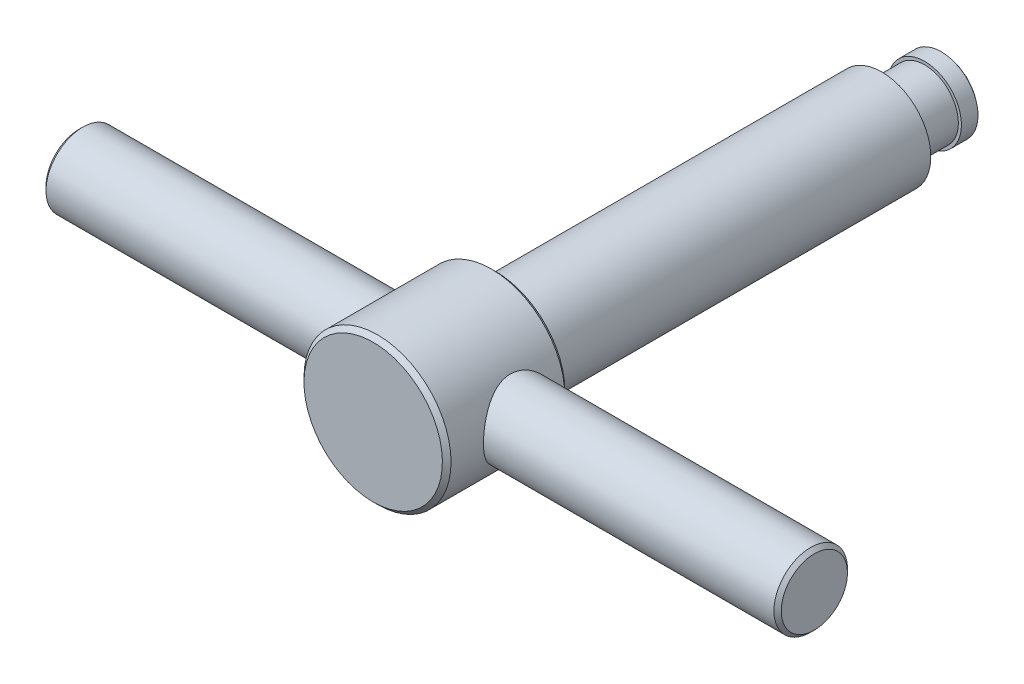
ISO-10303-21;
HEADER;
FILE_DESCRIPTION(('STEP AP214'),'2;1');
FILE_NAME('part.step','',(''),(''),'','','');
FILE_SCHEMA(('AUTOMOTIVE_DESIGN { 1 0 10303 214 1 1 1 1 }'));
ENDSEC;
DATA;
#1=APPLICATION_CONTEXT('core data for automotive mechanical design processes');
#2=APPLICATION_PROTOCOL_DEFINITION('international standard','automotive_design',2000,#1);
#3=PRODUCT_CONTEXT('',#1,'mechanical');
#4=PRODUCT('Part','Part','',(#3));
#5=PRODUCT_RELATED_PRODUCT_CATEGORY('part','',(#4));
#6=PRODUCT_DEFINITION_FORMATION('','',#4);
#7=PRODUCT_DEFINITION_CONTEXT('part definition',#1,'design');
#8=PRODUCT_DEFINITION('design','',#6,#7);
#9=PRODUCT_DEFINITION_SHAPE('','',#8);
#10=(LENGTH_UNIT() NAMED_UNIT(*) SI_UNIT(.MILLI.,.METRE.));
#11=(NAMED_UNIT(*) PLANE_ANGLE_UNIT() SI_UNIT($,.RADIAN.));
#12=(NAMED_UNIT(*) SI_UNIT($,.STERADIAN.) SOLID_ANGLE_UNIT());
#13=UNCERTAINTY_MEASURE_WITH_UNIT(LENGTH_MEASURE(1.E-05),#10,'distance_accuracy_value','');
#14=(GEOMETRIC_REPRESENTATION_CONTEXT(3) GLOBAL_UNCERTAINTY_ASSIGNED_CONTEXT((#13)) GLOBAL_UNIT_ASSIGNED_CONTEXT((#10,
#11,#12)) REPRESENTATION_CONTEXT('',''));
#15=CARTESIAN_POINT('',(0.,0.,0.));
#16=DIRECTION('',(0.,0.,1.));
#17=DIRECTION('',(1.,0.,0.));
#18=AXIS2_PLACEMENT_3D('',#15,#16,#17);
#19=CARTESIAN_POINT('',(-60.,0.,88.4));
#20=DIRECTION('',(1.,0.,0.));
#21=DIRECTION('',(0.,1.,0.));
#22=AXIS2_PLACEMENT_3D('',#19,#20,#21);
#23=PLANE('',#22);
#24=CARTESIAN_POINT('',(-60.0000000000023,0.,83.));
#25=DIRECTION('',(1.,0.,0.));
#26=DIRECTION('',(0.,1.,0.));
#27=AXIS2_PLACEMENT_3D('',#24,#25,#26);
#28=CIRCLE('',#27,5.39999999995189);
#29=CARTESIAN_POINT('',(-60.0000000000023,5.39999999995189,83.));
#30=VERTEX_POINT('',#29);
#31=EDGE_CURVE('E15',#30,#30,#28,.T.);
#32=ORIENTED_EDGE('',*,*,#31,.F.);
#33=EDGE_LOOP('',(#32));
#34=FACE_BOUND('',#33,.T.);
#35=ADVANCED_FACE('F12',(#34),#23,.F.);
#36=CARTESIAN_POINT('',(60.,0.,83.));
#37=DIRECTION('',(-1.,0.,0.));
#38=DIRECTION('',(0.,-1.,0.));
#39=AXIS2_PLACEMENT_3D('',#36,#37,#38);
#40=PLANE('',#39);
#41=CARTESIAN_POINT('',(60.0000000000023,0.,83.));
#42=DIRECTION('',(-1.,0.,0.));
#43=DIRECTION('',(0.,0.,1.));
#44=AXIS2_PLACEMENT_3D('',#41,#42,#43);
#45=CIRCLE('',#44,5.40000000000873);
#46=CARTESIAN_POINT('',(60.0000000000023,0.,88.4000000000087));
#47=VERTEX_POINT('',#46);
#48=EDGE_CURVE('E133',#47,#47,#45,.T.);
#49=ORIENTED_EDGE('',*,*,#48,.F.);
#50=EDGE_LOOP('',(#49));
#51=FACE_BOUND('',#50,.T.);
#52=ADVANCED_FACE('F171',(#51),#40,.F.);
#53=CARTESIAN_POINT('',(0.,0.,9.));
#54=DIRECTION('',(1.,0.,0.));
#55=DIRECTION('',(0.,-1.,0.));
#56=AXIS2_PLACEMENT_3D('',#53,#54,#55);
#57=SPHERICAL_SURFACE('',#56,9.);
#58=CARTESIAN_POINT('',(0.,0.,2.29179606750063));
#59=DIRECTION('',(0.,0.,1.));
#60=DIRECTION('',(0.,1.,0.));
#61=AXIS2_PLACEMENT_3D('',#58,#59,#60);
#62=CIRCLE('',#61,6.);
#63=CARTESIAN_POINT('',(0.,6.,2.29179606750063));
#64=VERTEX_POINT('',#63);
#65=EDGE_CURVE('E126',#64,#64,#62,.T.);
#66=ORIENTED_EDGE('',*,*,#65,.F.);
#67=EDGE_LOOP('',(#66));
#68=FACE_BOUND('',#67,.T.);
#69=ADVANCED_FACE('F168',(#68),#57,.T.);
#70=CARTESIAN_POINT('',(-59.400000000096,0.,83.));
#71=DIRECTION('',(1.,0.,0.));
#72=DIRECTION('',(0.,1.,0.));
#73=AXIS2_PLACEMENT_3D('',#70,#71,#72);
#74=CONICAL_SURFACE('',#73,5.99999999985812,0.785398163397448);
#75=CARTESIAN_POINT('',(-59.4,0.,83.));
#76=DIRECTION('',(1.,0.,0.));
#77=DIRECTION('',(0.,1.,0.));
#78=AXIS2_PLACEMENT_3D('',#75,#76,#77);
#79=CIRCLE('',#78,6.);
#80=CARTESIAN_POINT('',(-59.4,6.,83.));
#81=VERTEX_POINT('',#80);
#82=EDGE_CURVE('E124',#81,#81,#79,.T.);
#83=ORIENTED_EDGE('',*,*,#82,.F.);
#84=EDGE_LOOP('',(#83));
#85=FACE_BOUND('',#84,.T.);
#86=ORIENTED_EDGE('',*,*,#31,.T.);
#87=EDGE_LOOP('',(#86));
#88=FACE_BOUND('',#87,.T.);
#89=ADVANCED_FACE('F164',(#85,#88),#74,.T.);
#90=CARTESIAN_POINT('',(0.,0.,95.));
#91=DIRECTION('',(0.,0.,-1.));
#92=DIRECTION('',(0.,-1.,0.));
#93=AXIS2_PLACEMENT_3D('',#90,#91,#92);
#94=PLANE('',#93);
#95=CARTESIAN_POINT('',(0.,0.,95.));
#96=DIRECTION('',(0.,0.,-1.));
#97=DIRECTION('',(0.,-1.,0.));
#98=AXIS2_PLACEMENT_3D('',#95,#96,#97);
#99=CIRCLE('',#98,11.2928932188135);
#100=CARTESIAN_POINT('',(0.,-11.2928932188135,95.));
#101=VERTEX_POINT('',#100);
#102=EDGE_CURVE('E121',#101,#101,#99,.T.);
#103=ORIENTED_EDGE('',*,*,#102,.F.);
#104=EDGE_LOOP('',(#103));
#105=FACE_BOUND('',#104,.T.);
#106=ADVANCED_FACE('F160',(#105),#94,.F.);
#107=CARTESIAN_POINT('',(59.3999999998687,0.,83.));
#108=DIRECTION('',(-1.,0.,0.));
#109=DIRECTION('',(0.,0.,1.));
#110=AXIS2_PLACEMENT_3D('',#107,#108,#109);
#111=CONICAL_SURFACE('',#110,6.00000000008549,0.785398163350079);
#112=ORIENTED_EDGE('',*,*,#48,.T.);
#113=EDGE_LOOP('',(#112));
#114=FACE_BOUND('',#113,.T.);
#115=CARTESIAN_POINT('',(59.4,0.,83.));
#116=DIRECTION('',(1.,0.,0.));
#117=DIRECTION('',(0.,1.,0.));
#118=AXIS2_PLACEMENT_3D('',#115,#116,#117);
#119=CIRCLE('',#118,6.);
#120=CARTESIAN_POINT('',(59.4,6.,83.));
#121=VERTEX_POINT('',#120);
#122=EDGE_CURVE('E117',#121,#121,#119,.F.);
#123=ORIENTED_EDGE('',*,*,#122,.F.);
#124=EDGE_LOOP('',(#123));
#125=FACE_BOUND('',#124,.T.);
#126=ADVANCED_FACE('F154',(#114,#125),#111,.T.);
#127=CARTESIAN_POINT('',(0.,0.,0.));
#128=DIRECTION('',(0.,0.,1.));
#129=DIRECTION('',(0.,1.,0.));
#130=AXIS2_PLACEMENT_3D('',#127,#128,#129);
#131=CYLINDRICAL_SURFACE('',#130,6.);
#132=CARTESIAN_POINT('',(0.,0.,5.));
#133=DIRECTION('',(0.,0.,1.));
#134=DIRECTION('',(0.,1.,0.));
#135=AXIS2_PLACEMENT_3D('',#132,#133,#134);
#136=CIRCLE('',#135,6.);
#137=CARTESIAN_POINT('',(0.,6.,5.));
#138=VERTEX_POINT('',#137);
#139=EDGE_CURVE('E120',#138,#138,#136,.F.);
#140=ORIENTED_EDGE('',*,*,#139,.T.);
#141=EDGE_LOOP('',(#140));
#142=FACE_BOUND('',#141,.T.);
#143=ORIENTED_EDGE('',*,*,#65,.T.);
#144=EDGE_LOOP('',(#143));
#145=FACE_BOUND('',#144,.T.);
#146=ADVANCED_FACE('F147',(#142,#145),#131,.T.);
#147=CARTESIAN_POINT('',(-60.,0.,83.));
#148=DIRECTION('',(1.,0.,0.));
#149=DIRECTION('',(0.,1.,0.));
#150=AXIS2_PLACEMENT_3D('',#147,#148,#149);
#151=CYLINDRICAL_SURFACE('',#150,6.);
#152=CARTESIAN_POINT('',(-10.3967296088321,-5.99232955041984,82.6967071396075));
#153=CARTESIAN_POINT('',(-10.4013641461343,-5.98428985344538,82.5378840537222));
#154=CARTESIAN_POINT('',(-10.4096334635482,-5.96993301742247,82.3794639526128));
#155=CARTESIAN_POINT('',(-10.4331256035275,-5.92878096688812,82.064706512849));
#156=CARTESIAN_POINT('',(-10.4483521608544,-5.90197907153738,81.9083703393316));
#157=CARTESIAN_POINT('',(-10.4852220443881,-5.83622654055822,81.5987339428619));
#158=CARTESIAN_POINT('',(-10.5068773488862,-5.79725321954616,81.4454399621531));
#159=CARTESIAN_POINT('',(-10.5558238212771,-5.70764223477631,81.1431995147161));
#160=CARTESIAN_POINT('',(-10.5831175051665,-5.65699936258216,80.9942550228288));
#161=CARTESIAN_POINT('',(-10.6717668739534,-5.48902587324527,80.5571602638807));
#162=CARTESIAN_POINT('',(-10.7401681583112,-5.35518386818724,80.2765932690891));
#163=CARTESIAN_POINT('',(-10.8880451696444,-5.04771900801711,79.7418006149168));
#164=CARTESIAN_POINT('',(-10.9675203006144,-4.87409829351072,79.4875735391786));
#165=CARTESIAN_POINT('',(-11.1370713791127,-4.47402221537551,78.9882416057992));
#166=CARTESIAN_POINT('',(-11.2274666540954,-4.24427471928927,78.7458775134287));
#167=CARTESIAN_POINT('',(-11.4032291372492,-3.74644538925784,78.3015590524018));
#168=CARTESIAN_POINT('',(-11.4885943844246,-3.47834874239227,78.0996203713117));
#169=CARTESIAN_POINT('',(-11.6079649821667,-3.04611998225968,77.8277879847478));
#170=CARTESIAN_POINT('',(-11.6469747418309,-2.89375494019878,77.740999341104));
#171=CARTESIAN_POINT('',(-11.720220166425,-2.58111511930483,77.5807143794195));
#172=CARTESIAN_POINT('',(-11.7544578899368,-2.42084379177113,77.5072123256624));
#173=CARTESIAN_POINT('',(-11.8171423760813,-2.0935399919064,77.3743192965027));
#174=CARTESIAN_POINT('',(-11.8455915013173,-1.92651031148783,77.3149225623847));
#175=CARTESIAN_POINT('',(-11.8958437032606,-1.58692880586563,77.210943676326));
#176=CARTESIAN_POINT('',(-11.9176475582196,-1.41437762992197,77.1663597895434));
#177=CARTESIAN_POINT('',(-11.9523359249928,-1.08044086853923,77.0958329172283));
#178=CARTESIAN_POINT('',(-11.9658310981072,-0.919388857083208,77.0686062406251));
#179=CARTESIAN_POINT('',(-11.9863301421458,-0.595197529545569,77.0273596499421));
#180=CARTESIAN_POINT('',(-11.9933345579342,-0.43205838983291,77.013338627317));
#181=CARTESIAN_POINT('',(-12.0006537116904,-0.105088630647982,76.9986893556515));
#182=CARTESIAN_POINT('',(-12.000970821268,0.0587417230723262,76.9980563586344));
#183=CARTESIAN_POINT('',(-11.9949122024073,0.385778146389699,77.0101797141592));
#184=CARTESIAN_POINT('',(-11.9885367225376,0.548984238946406,77.0229355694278));
#185=CARTESIAN_POINT('',(-11.9699803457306,0.861547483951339,77.0602468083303));
#186=CARTESIAN_POINT('',(-11.9582582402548,1.01104436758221,77.0838707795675));
#187=CARTESIAN_POINT('',(-11.9294981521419,1.30738064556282,77.1422213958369));
#188=CARTESIAN_POINT('',(-11.9124584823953,1.45421918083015,77.1769515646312));
#189=CARTESIAN_POINT('',(-11.8734615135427,1.74421949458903,77.2571507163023));
#190=CARTESIAN_POINT('',(-11.8515056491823,1.88738233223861,77.3026165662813));
#191=CARTESIAN_POINT('',(-11.8031687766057,2.1692638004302,77.4038621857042));
#192=CARTESIAN_POINT('',(-11.7767860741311,2.30798070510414,77.4596459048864));
#193=CARTESIAN_POINT('',(-11.6898816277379,2.72563439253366,77.6459566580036));
#194=CARTESIAN_POINT('',(-11.6229758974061,2.99621625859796,77.7927137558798));
#195=CARTESIAN_POINT('',(-11.4783693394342,3.50976933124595,78.1240252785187));
#196=CARTESIAN_POINT('',(-11.4006635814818,3.75272783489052,78.308596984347));
#197=CARTESIAN_POINT('',(-11.232947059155,4.22976715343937,78.7314543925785));
#198=CARTESIAN_POINT('',(-11.1424800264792,4.46058169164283,78.9732506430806));
#199=CARTESIAN_POINT('',(-10.9653912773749,4.87976233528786,79.4929605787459));
#200=CARTESIAN_POINT('',(-10.8787720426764,5.06810135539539,79.7708971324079));
#201=CARTESIAN_POINT('',(-10.7575950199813,5.31819877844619,80.2165709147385));
#202=CARTESIAN_POINT('',(-10.7179644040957,5.39739296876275,80.373371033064));
#203=CARTESIAN_POINT('',(-10.6438649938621,5.54208804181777,80.6943115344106));
#204=CARTESIAN_POINT('',(-10.6093937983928,5.60759529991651,80.8584484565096));
#205=CARTESIAN_POINT('',(-10.5469857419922,5.72411263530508,81.1928308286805));
#206=CARTESIAN_POINT('',(-10.5190431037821,5.77513553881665,81.3630707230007));
#207=CARTESIAN_POINT('',(-10.4708608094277,5.86204340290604,81.7084371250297));
#208=CARTESIAN_POINT('',(-10.4506199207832,5.89793078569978,81.883562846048));
#209=CARTESIAN_POINT('',(-10.4204111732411,5.95112289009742,82.2190020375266));
#210=CARTESIAN_POINT('',(-10.4096046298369,5.96995227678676,82.3789994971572));
#211=CARTESIAN_POINT('',(-10.3953867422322,5.99467617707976,82.7003127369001));
#212=CARTESIAN_POINT('',(-10.391974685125,6.00057193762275,82.8616283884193));
#213=CARTESIAN_POINT('',(-10.3926854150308,5.99934075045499,83.1841480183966));
#214=CARTESIAN_POINT('',(-10.3968061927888,5.99221727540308,83.3453520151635));
#215=CARTESIAN_POINT('',(-10.4124091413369,5.96506323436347,83.6663014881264));
#216=CARTESIAN_POINT('',(-10.4238910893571,5.9450330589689,83.8260470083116));
#217=CARTESIAN_POINT('',(-10.4524366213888,5.89468609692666,84.1287553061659));
#218=CARTESIAN_POINT('',(-10.4689163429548,5.86543648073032,84.2719522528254));
#219=CARTESIAN_POINT('',(-10.5070880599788,5.79677768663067,84.5551948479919));
#220=CARTESIAN_POINT('',(-10.5287816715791,5.75736535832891,84.6952395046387));
#221=CARTESIAN_POINT('',(-10.6007490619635,5.62444241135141,85.1094068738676));
#222=CARTESIAN_POINT('',(-10.6579286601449,5.51621366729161,85.3777530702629));
#223=CARTESIAN_POINT('',(-10.7895116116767,5.25445945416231,85.9130963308));
#224=CARTESIAN_POINT('',(-10.8648878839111,5.09813619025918,86.178469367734));
#225=CARTESIAN_POINT('',(-11.0223936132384,4.74802594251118,86.6810562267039));
#226=CARTESIAN_POINT('',(-11.1045270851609,4.55421659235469,86.9182531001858));
#227=CARTESIAN_POINT('',(-11.2779849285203,4.10741265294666,87.3870135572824));
#228=CARTESIAN_POINT('',(-11.3692423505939,3.85012262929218,87.614562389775));
#229=CARTESIAN_POINT('',(-11.4983181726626,3.43652386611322,87.9213704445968));
#230=CARTESIAN_POINT('',(-11.5400655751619,3.29394837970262,88.0179372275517));
#231=CARTESIAN_POINT('',(-11.6198691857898,3.00028881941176,88.1988420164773));
#232=CARTESIAN_POINT('',(-11.6579271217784,2.84920878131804,88.2831857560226));
#233=CARTESIAN_POINT('',(-11.7292455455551,2.53968300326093,88.4387471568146));
#234=CARTESIAN_POINT('',(-11.7625139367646,2.38124998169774,88.5099864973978));
#235=CARTESIAN_POINT('',(-11.823367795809,2.05791468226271,88.6387271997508));
#236=CARTESIAN_POINT('',(-11.8509559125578,1.89301546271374,88.696234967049));
#237=CARTESIAN_POINT('',(-11.8996299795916,1.55802349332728,88.7968207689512));
#238=CARTESIAN_POINT('',(-11.9207192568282,1.38793345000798,88.8399061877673));
#239=CARTESIAN_POINT('',(-11.9557555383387,1.04392825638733,88.9110958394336));
#240=CARTESIAN_POINT('',(-11.9697033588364,0.870013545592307,88.9392017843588));
#241=CARTESIAN_POINT('',(-11.9890057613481,0.537308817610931,88.97800203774));
#242=CARTESIAN_POINT('',(-11.9950748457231,0.37872756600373,88.9901455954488));
#243=CARTESIAN_POINT('',(-12.0008966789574,0.0609889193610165,89.0017954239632));
#244=CARTESIAN_POINT('',(-12.0006498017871,-0.098168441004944,89.001302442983));
#245=CARTESIAN_POINT('',(-11.9938467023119,-0.415774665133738,88.9876867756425));
#246=CARTESIAN_POINT('',(-11.9872916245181,-0.574223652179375,88.9745663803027));
#247=CARTESIAN_POINT('',(-11.9680493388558,-0.889210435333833,88.9358643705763));
#248=CARTESIAN_POINT('',(-11.9553621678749,-1.04574824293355,88.9102828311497));
#249=CARTESIAN_POINT('',(-11.9249214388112,-1.34843417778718,88.8484563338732));
#250=CARTESIAN_POINT('',(-11.9074352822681,-1.49472395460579,88.8127716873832));
#251=CARTESIAN_POINT('',(-11.8676036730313,-1.78361750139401,88.7307319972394));
#252=CARTESIAN_POINT('',(-11.8452566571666,-1.92622006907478,88.6843735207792));
#253=CARTESIAN_POINT('',(-11.7716506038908,-2.34715104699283,88.5299236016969));
#254=CARTESIAN_POINT('',(-11.7138014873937,-2.61884038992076,88.4064084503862));
#255=CARTESIAN_POINT('',(-11.5814931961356,-3.15433303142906,88.1136109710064));
#256=CARTESIAN_POINT('',(-11.5062385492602,-3.41665496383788,87.9420044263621));
#257=CARTESIAN_POINT('',(-11.3480294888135,-3.91017467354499,87.5615510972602));
#258=CARTESIAN_POINT('',(-11.2650706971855,-4.14135456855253,87.3526830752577));
#259=CARTESIAN_POINT('',(-11.0904884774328,-4.58959419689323,86.8796570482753));
#260=CARTESIAN_POINT('',(-10.9988086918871,-4.80308099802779,86.6120941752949));
#261=CARTESIAN_POINT('',(-10.868582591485,-5.08771873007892,86.1850446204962));
#262=CARTESIAN_POINT('',(-10.8263558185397,-5.17672801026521,86.038271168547));
#263=CARTESIAN_POINT('',(-10.7456657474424,-5.34220185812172,85.7368577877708));
#264=CARTESIAN_POINT('',(-10.707200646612,-5.41867244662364,85.5822216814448));
#265=CARTESIAN_POINT('',(-10.6351987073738,-5.55866739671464,85.2652529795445));
#266=CARTESIAN_POINT('',(-10.601683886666,-5.62213437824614,85.1028900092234));
#267=CARTESIAN_POINT('',(-10.5410848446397,-5.73494845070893,84.7722447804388));
#268=CARTESIAN_POINT('',(-10.5139971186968,-5.7843032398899,84.6039658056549));
#269=CARTESIAN_POINT('',(-10.4674355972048,-5.86814204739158,84.2631789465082));
#270=CARTESIAN_POINT('',(-10.4479420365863,-5.90266469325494,84.0906832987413));
#271=CARTESIAN_POINT('',(-10.4173697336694,-5.95645689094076,83.7426839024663));
#272=CARTESIAN_POINT('',(-10.4062850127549,-5.97573728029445,83.5671823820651));
#273=CARTESIAN_POINT('',(-10.3953148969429,-5.99478823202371,83.2755481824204));
#274=CARTESIAN_POINT('',(-10.3928876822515,-5.99899031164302,83.15977751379));
#275=CARTESIAN_POINT('',(-10.3919080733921,-6.00068740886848,82.9281690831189));
#276=CARTESIAN_POINT('',(-10.393355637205,-5.99818249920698,82.8123313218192));
#277=CARTESIAN_POINT('',(-10.3967296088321,-5.99232955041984,82.6967071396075));
#278=B_SPLINE_CURVE_WITH_KNOTS('',3,(#152,#153,#154,#155,#156,#157,#158,#159,#160,#161,#162,
#163,#164,#165,#166,#167,#168,#169,#170,#171,#172,#173,#174,#175,#176,#177,#178,#179,#180,#181,
#182,#183,#184,#185,#186,#187,#188,#189,#190,#191,#192,#193,#194,#195,#196,#197,#198,#199,#200,
#201,#202,#203,#204,#205,#206,#207,#208,#209,#210,#211,#212,#213,#214,#215,#216,#217,#218,#219,
#220,#221,#222,#223,#224,#225,#226,#227,#228,#229,#230,#231,#232,#233,#234,#235,#236,#237,#238,
#239,#240,#241,#242,#243,#244,#245,#246,#247,#248,#249,#250,#251,#252,#253,#254,#255,#256,#257,
#258,#259,#260,#261,#262,#263,#264,#265,#266,#267,#268,#269,#270,#271,#272,#273,#274,#275,#276,
#277),.UNSPECIFIED.,.T.,.F.,(4,2,2,2,2,2,2,2,2,2,2,2,2,2,2,2,2,2,2,2,2,2,2,2,2,2,2,2,2,2,2,2,2,
2,2,2,2,2,2,2,2,2,2,2,2,2,2,2,2,2,2,2,2,2,2,2,2,2,2,2,2,2,4),(0.,0.47715767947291,
0.954571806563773,1.43288111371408,1.91140431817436,2.86186573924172,3.81227602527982,
4.84577885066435,5.8796819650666,6.41798239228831,6.95604988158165,7.49389731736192,
8.03168173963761,8.52270914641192,9.01369533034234,9.50450738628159,9.99530121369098,
10.4501927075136,10.905228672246,11.3601320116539,11.8152098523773,12.7559779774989,
13.6971769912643,14.7316562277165,15.7667932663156,16.3064145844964,16.8457839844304,
17.3846742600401,17.923478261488,18.4071994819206,18.8908740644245,19.3744196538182,
19.8579506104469,20.298691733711,20.739569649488,21.6207508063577,22.5683036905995,
23.5164236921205,24.5771474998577,25.1081792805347,25.6389611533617,26.1688568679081,
26.6985049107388,27.2278813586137,27.7571972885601,28.2340678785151,28.7109102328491,
29.187666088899,29.6644190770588,30.118669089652,30.5730653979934,31.4811344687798,
32.4443599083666,33.4081361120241,34.4658570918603,34.9956433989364,35.5251745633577,
36.0569942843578,36.5885233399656,37.1186596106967,37.6484186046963,37.9957960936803,
38.3431698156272),.UNSPECIFIED.);
#279=CARTESIAN_POINT('',(-10.3967296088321,-5.99232955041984,82.6967071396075));
#280=VERTEX_POINT('',#279);
#281=EDGE_CURVE('E46',#280,#280,#278,.T.);
#282=ORIENTED_EDGE('',*,*,#281,.F.);
#283=EDGE_LOOP('',(#282));
#284=FACE_BOUND('',#283,.T.);
#285=ORIENTED_EDGE('',*,*,#82,.T.);
#286=EDGE_LOOP('',(#285));
#287=FACE_BOUND('',#286,.T.);
#288=ADVANCED_FACE('F145',(#284,#287),#151,.T.);
#289=CARTESIAN_POINT('',(0.,0.,94.2928932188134));
#290=DIRECTION('',(0.,0.,-1.));
#291=DIRECTION('',(0.,-1.,0.));
#292=AXIS2_PLACEMENT_3D('',#289,#290,#291);
#293=CONICAL_SURFACE('',#292,12.,0.78539816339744);
#294=ORIENTED_EDGE('',*,*,#102,.T.);
#295=EDGE_LOOP('',(#294));
#296=FACE_BOUND('',#295,.T.);
#297=CARTESIAN_POINT('',(0.,0.,94.2928932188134));
#298=DIRECTION('',(0.,0.,1.));
#299=DIRECTION('',(0.,1.,0.));
#300=AXIS2_PLACEMENT_3D('',#297,#298,#299);
#301=CIRCLE('',#300,12.);
#302=CARTESIAN_POINT('',(0.,12.,94.2928932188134));
#303=VERTEX_POINT('',#302);
#304=EDGE_CURVE('E45',#303,#303,#301,.F.);
#305=ORIENTED_EDGE('',*,*,#304,.F.);
#306=EDGE_LOOP('',(#305));
#307=FACE_BOUND('',#306,.T.);
#308=ADVANCED_FACE('F72',(#296,#307),#293,.T.);
#309=CARTESIAN_POINT('',(-60.,0.,83.));
#310=DIRECTION('',(1.,0.,0.));
#311=DIRECTION('',(0.,1.,0.));
#312=AXIS2_PLACEMENT_3D('',#309,#310,#311);
#313=CYLINDRICAL_SURFACE('',#312,6.);
#314=ORIENTED_EDGE('',*,*,#122,.T.);
#315=EDGE_LOOP('',(#314));
#316=FACE_BOUND('',#315,.T.);
#317=CARTESIAN_POINT('',(10.3967296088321,-5.99232955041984,83.3032928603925));
#318=CARTESIAN_POINT('',(10.4013641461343,-5.98428985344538,83.4621159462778));
#319=CARTESIAN_POINT('',(10.4096334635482,-5.96993301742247,83.6205360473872));
#320=CARTESIAN_POINT('',(10.4331256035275,-5.92878096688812,83.935293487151));
#321=CARTESIAN_POINT('',(10.4483521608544,-5.90197907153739,84.0916296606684));
#322=CARTESIAN_POINT('',(10.4852220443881,-5.83622654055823,84.4012660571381));
#323=CARTESIAN_POINT('',(10.5068773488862,-5.79725321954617,84.5545600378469));
#324=CARTESIAN_POINT('',(10.5558238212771,-5.70764223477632,84.8568004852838));
#325=CARTESIAN_POINT('',(10.5831175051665,-5.65699936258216,85.0057449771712));
#326=CARTESIAN_POINT('',(10.6717668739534,-5.48902587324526,85.4428397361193));
#327=CARTESIAN_POINT('',(10.7401681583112,-5.35518386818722,85.7234067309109));
#328=CARTESIAN_POINT('',(10.8880451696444,-5.0477190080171,86.2581993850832));
#329=CARTESIAN_POINT('',(10.9675203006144,-4.87409829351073,86.5124264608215));
#330=CARTESIAN_POINT('',(11.1370713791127,-4.47402221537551,87.0117583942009));
#331=CARTESIAN_POINT('',(11.2274666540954,-4.24427471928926,87.2541224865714));
#332=CARTESIAN_POINT('',(11.4032291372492,-3.74644538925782,87.6984409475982));
#333=CARTESIAN_POINT('',(11.4885943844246,-3.47834874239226,87.9003796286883));
#334=CARTESIAN_POINT('',(11.6079649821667,-3.04611998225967,88.1722120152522));
#335=CARTESIAN_POINT('',(11.6469747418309,-2.89375494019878,88.259000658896));
#336=CARTESIAN_POINT('',(11.720220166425,-2.58111511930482,88.4192856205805));
#337=CARTESIAN_POINT('',(11.7544578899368,-2.42084379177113,88.4927876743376));
#338=CARTESIAN_POINT('',(11.8171423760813,-2.09353999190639,88.6256807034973));
#339=CARTESIAN_POINT('',(11.8455915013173,-1.92651031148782,88.6850774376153));
#340=CARTESIAN_POINT('',(11.8958437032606,-1.58692880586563,88.789056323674));
#341=CARTESIAN_POINT('',(11.9176475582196,-1.41437762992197,88.8336402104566));
#342=CARTESIAN_POINT('',(11.9523359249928,-1.08044086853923,88.9041670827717));
#343=CARTESIAN_POINT('',(11.9658310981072,-0.919388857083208,88.9313937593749));
#344=CARTESIAN_POINT('',(11.9863301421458,-0.595197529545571,88.9726403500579));
#345=CARTESIAN_POINT('',(11.9933345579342,-0.432058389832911,88.986661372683));
#346=CARTESIAN_POINT('',(12.0006537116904,-0.105088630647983,89.0013106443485));
#347=CARTESIAN_POINT('',(12.000970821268,0.0587417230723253,89.0019436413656));
#348=CARTESIAN_POINT('',(11.9949122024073,0.385778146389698,88.9898202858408));
#349=CARTESIAN_POINT('',(11.9885367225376,0.548984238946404,88.9770644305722));
#350=CARTESIAN_POINT('',(11.9699803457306,0.861547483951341,88.9397531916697));
#351=CARTESIAN_POINT('',(11.9582582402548,1.01104436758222,88.9161292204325));
#352=CARTESIAN_POINT('',(11.9294981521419,1.30738064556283,88.8577786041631));
#353=CARTESIAN_POINT('',(11.9124584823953,1.45421918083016,88.8230484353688));
#354=CARTESIAN_POINT('',(11.8734615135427,1.74421949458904,88.7428492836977));
#355=CARTESIAN_POINT('',(11.8515056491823,1.88738233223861,88.6973834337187));
#356=CARTESIAN_POINT('',(11.8031687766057,2.1692638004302,88.5961378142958));
#357=CARTESIAN_POINT('',(11.7767860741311,2.30798070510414,88.5403540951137));
#358=CARTESIAN_POINT('',(11.6898816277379,2.72563439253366,88.3540433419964));
#359=CARTESIAN_POINT('',(11.6229758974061,2.99621625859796,88.2072862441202));
#360=CARTESIAN_POINT('',(11.4783693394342,3.50976933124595,87.8759747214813));
#361=CARTESIAN_POINT('',(11.4006635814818,3.75272783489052,87.691403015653));
#362=CARTESIAN_POINT('',(11.232947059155,4.22976715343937,87.2685456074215));
#363=CARTESIAN_POINT('',(11.1424800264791,4.46058169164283,87.0267493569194));
#364=CARTESIAN_POINT('',(10.9653912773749,4.87976233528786,86.5070394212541));
#365=CARTESIAN_POINT('',(10.8787720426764,5.06810135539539,86.2291028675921));
#366=CARTESIAN_POINT('',(10.7575950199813,5.3181987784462,85.7834290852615));
#367=CARTESIAN_POINT('',(10.7179644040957,5.39739296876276,85.626628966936));
#368=CARTESIAN_POINT('',(10.6438649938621,5.54208804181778,85.3056884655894));
#369=CARTESIAN_POINT('',(10.6093937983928,5.60759529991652,85.1415515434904));
#370=CARTESIAN_POINT('',(10.5469857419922,5.72411263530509,84.8071691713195));
#371=CARTESIAN_POINT('',(10.5190431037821,5.77513553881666,84.6369292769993));
#372=CARTESIAN_POINT('',(10.4708608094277,5.86204340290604,84.2915628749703));
#373=CARTESIAN_POINT('',(10.4506199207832,5.89793078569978,84.116437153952));
#374=CARTESIAN_POINT('',(10.4204111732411,5.95112289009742,83.7809979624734));
#375=CARTESIAN_POINT('',(10.4096046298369,5.96995227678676,83.6210005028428));
#376=CARTESIAN_POINT('',(10.3953867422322,5.99467617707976,83.2996872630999));
#377=CARTESIAN_POINT('',(10.391974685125,6.00057193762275,83.1383716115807));
#378=CARTESIAN_POINT('',(10.3926854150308,5.99934075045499,82.8158519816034));
#379=CARTESIAN_POINT('',(10.3968061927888,5.99221727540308,82.6546479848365));
#380=CARTESIAN_POINT('',(10.4124091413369,5.96506323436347,82.3336985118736));
#381=CARTESIAN_POINT('',(10.4238910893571,5.9450330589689,82.1739529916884));
#382=CARTESIAN_POINT('',(10.4524366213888,5.89468609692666,81.8712446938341));
#383=CARTESIAN_POINT('',(10.4689163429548,5.86543648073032,81.7280477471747));
#384=CARTESIAN_POINT('',(10.5070880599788,5.79677768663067,81.4448051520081));
#385=CARTESIAN_POINT('',(10.5287816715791,5.75736535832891,81.3047604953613));
#386=CARTESIAN_POINT('',(10.6007490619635,5.6244424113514,80.8905931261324));
#387=CARTESIAN_POINT('',(10.6579286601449,5.51621366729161,80.6222469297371));
#388=CARTESIAN_POINT('',(10.7895116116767,5.25445945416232,80.0869036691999));
#389=CARTESIAN_POINT('',(10.8648878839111,5.09813619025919,79.8215306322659));
#390=CARTESIAN_POINT('',(11.0223936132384,4.74802594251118,79.3189437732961));
#391=CARTESIAN_POINT('',(11.1045270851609,4.55421659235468,79.0817468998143));
#392=CARTESIAN_POINT('',(11.2779849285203,4.10741265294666,78.6129864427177));
#393=CARTESIAN_POINT('',(11.3692423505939,3.8501226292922,78.3854376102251));
#394=CARTESIAN_POINT('',(11.4983181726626,3.43652386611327,78.0786295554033));
#395=CARTESIAN_POINT('',(11.5400655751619,3.29394837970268,77.9820627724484));
#396=CARTESIAN_POINT('',(11.6198691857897,3.0002888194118,77.8011579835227));
#397=CARTESIAN_POINT('',(11.6579271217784,2.84920878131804,77.7168142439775));
#398=CARTESIAN_POINT('',(11.7292455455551,2.53968300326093,77.5612528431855));
#399=CARTESIAN_POINT('',(11.7625139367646,2.38124998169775,77.4900135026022));
#400=CARTESIAN_POINT('',(11.823367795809,2.05791468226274,77.3612728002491));
#401=CARTESIAN_POINT('',(11.8509559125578,1.89301546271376,77.303765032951));
#402=CARTESIAN_POINT('',(11.8996299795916,1.5580234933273,77.2031792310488));
#403=CARTESIAN_POINT('',(11.9207192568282,1.387933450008,77.1600938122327));
#404=CARTESIAN_POINT('',(11.9557555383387,1.04392825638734,77.0889041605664));
#405=CARTESIAN_POINT('',(11.9697033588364,0.870013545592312,77.0607982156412));
#406=CARTESIAN_POINT('',(11.9890057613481,0.537308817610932,77.02199796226));
#407=CARTESIAN_POINT('',(11.9950748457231,0.378727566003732,77.0098544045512));
#408=CARTESIAN_POINT('',(12.0008966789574,0.060988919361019,76.9982045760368));
#409=CARTESIAN_POINT('',(12.0006498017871,-0.0981684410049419,76.998697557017));
#410=CARTESIAN_POINT('',(11.9938467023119,-0.415774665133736,77.0123132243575));
#411=CARTESIAN_POINT('',(11.9872916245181,-0.574223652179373,77.0254336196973));
#412=CARTESIAN_POINT('',(11.9680493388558,-0.889210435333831,77.0641356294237));
#413=CARTESIAN_POINT('',(11.9553621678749,-1.04574824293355,77.0897171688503));
#414=CARTESIAN_POINT('',(11.9249214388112,-1.34843417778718,77.1515436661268));
#415=CARTESIAN_POINT('',(11.9074352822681,-1.49472395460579,77.1872283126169));
#416=CARTESIAN_POINT('',(11.8676036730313,-1.78361750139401,77.2692680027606));
#417=CARTESIAN_POINT('',(11.8452566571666,-1.92622006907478,77.3156264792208));
#418=CARTESIAN_POINT('',(11.7716506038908,-2.34715104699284,77.4700763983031));
#419=CARTESIAN_POINT('',(11.7138014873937,-2.61884038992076,77.5935915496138));
#420=CARTESIAN_POINT('',(11.5814931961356,-3.15433303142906,77.8863890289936));
#421=CARTESIAN_POINT('',(11.5062385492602,-3.41665496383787,78.0579955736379));
#422=CARTESIAN_POINT('',(11.3480294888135,-3.91017467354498,78.4384489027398));
#423=CARTESIAN_POINT('',(11.2650706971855,-4.14135456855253,78.6473169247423));
#424=CARTESIAN_POINT('',(11.0904884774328,-4.58959419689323,79.1203429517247));
#425=CARTESIAN_POINT('',(10.9988086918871,-4.80308099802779,79.3879058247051));
#426=CARTESIAN_POINT('',(10.868582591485,-5.08771873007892,79.8149553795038));
#427=CARTESIAN_POINT('',(10.8263558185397,-5.17672801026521,79.961728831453));
#428=CARTESIAN_POINT('',(10.7456657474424,-5.34220185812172,80.2631422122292));
#429=CARTESIAN_POINT('',(10.707200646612,-5.41867244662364,80.4177783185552));
#430=CARTESIAN_POINT('',(10.6351987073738,-5.55866739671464,80.7347470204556));
#431=CARTESIAN_POINT('',(10.601683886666,-5.62213437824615,80.8971099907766));
#432=CARTESIAN_POINT('',(10.5410848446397,-5.73494845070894,81.2277552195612));
#433=CARTESIAN_POINT('',(10.5139971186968,-5.7843032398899,81.3960341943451));
#434=CARTESIAN_POINT('',(10.4674355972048,-5.86814204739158,81.7368210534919));
#435=CARTESIAN_POINT('',(10.4479420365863,-5.90266469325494,81.9093167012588));
#436=CARTESIAN_POINT('',(10.4173697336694,-5.95645689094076,82.2573160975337));
#437=CARTESIAN_POINT('',(10.4062850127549,-5.97573728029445,82.4328176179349));
#438=CARTESIAN_POINT('',(10.3953148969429,-5.99478823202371,82.7244518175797));
#439=CARTESIAN_POINT('',(10.3928876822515,-5.99899031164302,82.84022248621));
#440=CARTESIAN_POINT('',(10.3919080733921,-6.00068740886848,83.0718309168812));
#441=CARTESIAN_POINT('',(10.393355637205,-5.99818249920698,83.1876686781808));
#442=CARTESIAN_POINT('',(10.3967296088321,-5.99232955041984,83.3032928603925));
#443=B_SPLINE_CURVE_WITH_KNOTS('',3,(#317,#318,#319,#320,#321,#322,#323,#324,#325,#326,#327,
#328,#329,#330,#331,#332,#333,#334,#335,#336,#337,#338,#339,#340,#341,#342,#343,#344,#345,#346,
#347,#348,#349,#350,#351,#352,#353,#354,#355,#356,#357,#358,#359,#360,#361,#362,#363,#364,#365,
#366,#367,#368,#369,#370,#371,#372,#373,#374,#375,#376,#377,#378,#379,#380,#381,#382,#383,#384,
#385,#386,#387,#388,#389,#390,#391,#392,#393,#394,#395,#396,#397,#398,#399,#400,#401,#402,#403,
#404,#405,#406,#407,#408,#409,#410,#411,#412,#413,#414,#415,#416,#417,#418,#419,#420,#421,#422,
#423,#424,#425,#426,#427,#428,#429,#430,#431,#432,#433,#434,#435,#436,#437,#438,#439,#440,#441,
#442),.UNSPECIFIED.,.T.,.F.,(4,2,2,2,2,2,2,2,2,2,2,2,2,2,2,2,2,2,2,2,2,2,2,2,2,2,2,2,2,2,2,2,2,
2,2,2,2,2,2,2,2,2,2,2,2,2,2,2,2,2,2,2,2,2,2,2,2,2,2,2,2,2,4),(0.,0.47715767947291,
0.954571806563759,1.43288111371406,1.91140431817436,2.86186573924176,3.8122760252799,
4.84577885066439,5.87968196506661,6.41798239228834,6.95604988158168,7.49389731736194,
8.03168173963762,8.52270914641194,9.01369533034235,9.50450738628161,9.995301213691,
10.4501927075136,10.905228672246,11.3601320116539,11.8152098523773,12.7559779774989,
13.6971769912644,14.7316562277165,15.7667932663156,16.3064145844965,16.8457839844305,
17.3846742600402,17.923478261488,18.4071994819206,18.8908740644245,19.3744196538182,
19.8579506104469,20.298691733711,20.739569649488,21.6207508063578,22.5683036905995,
23.5164236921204,24.5771474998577,25.1081792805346,25.6389611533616,26.1688568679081,
26.6985049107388,27.2278813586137,27.7571972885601,28.2340678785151,28.7109102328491,
29.187666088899,29.6644190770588,30.1186690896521,30.5730653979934,31.4811344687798,
32.4443599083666,33.4081361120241,34.4658570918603,34.9956433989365,35.5251745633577,
36.0569942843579,36.5885233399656,37.1186596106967,37.6484186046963,37.9957960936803,
38.3431698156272),.UNSPECIFIED.);
#444=CARTESIAN_POINT('',(10.3967296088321,-5.99232955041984,83.3032928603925));
#445=VERTEX_POINT('',#444);
#446=EDGE_CURVE('E37',#445,#445,#443,.T.);
#447=ORIENTED_EDGE('',*,*,#446,.F.);
#448=EDGE_LOOP('',(#447));
#449=FACE_BOUND('',#448,.T.);
#450=ADVANCED_FACE('F52',(#316,#449),#313,.T.);
#451=CARTESIAN_POINT('',(-5.5,0.,5.));
#452=DIRECTION('',(0.,0.,-1.));
#453=DIRECTION('',(0.,-1.,0.));
#454=AXIS2_PLACEMENT_3D('',#451,#452,#453);
#455=PLANE('',#454);
#456=CARTESIAN_POINT('',(0.,0.,5.));
#457=DIRECTION('',(0.,0.,1.));
#458=DIRECTION('',(0.,1.,0.));
#459=AXIS2_PLACEMENT_3D('',#456,#457,#458);
#460=CIRCLE('',#459,5.5);
#461=CARTESIAN_POINT('',(0.,5.5,5.));
#462=VERTEX_POINT('',#461);
#463=EDGE_CURVE('E33',#462,#462,#460,.T.);
#464=ORIENTED_EDGE('',*,*,#463,.F.);
#465=EDGE_LOOP('',(#464));
#466=FACE_BOUND('',#465,.T.);
#467=ORIENTED_EDGE('',*,*,#139,.F.);
#468=EDGE_LOOP('',(#467));
#469=FACE_BOUND('',#468,.T.);
#470=ADVANCED_FACE('F61',(#466,#469),#455,.F.);
#471=CARTESIAN_POINT('',(0.,0.,0.));
#472=DIRECTION('',(0.,0.,1.));
#473=DIRECTION('',(0.,1.,0.));
#474=AXIS2_PLACEMENT_3D('',#471,#472,#473);
#475=CYLINDRICAL_SURFACE('',#474,12.);
#476=ORIENTED_EDGE('',*,*,#446,.T.);
#477=EDGE_LOOP('',(#476));
#478=FACE_BOUND('',#477,.T.);
#479=ORIENTED_EDGE('',*,*,#304,.T.);
#480=EDGE_LOOP('',(#479));
#481=FACE_BOUND('',#480,.T.);
#482=ORIENTED_EDGE('',*,*,#281,.T.);
#483=EDGE_LOOP('',(#482));
#484=FACE_BOUND('',#483,.T.);
#485=CARTESIAN_POINT('',(0.,0.,75.7071067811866));
#486=DIRECTION('',(0.,0.,1.));
#487=DIRECTION('',(0.,1.,0.));
#488=AXIS2_PLACEMENT_3D('',#485,#486,#487);
#489=CIRCLE('',#488,12.);
#490=CARTESIAN_POINT('',(0.,12.,75.7071067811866));
#491=VERTEX_POINT('',#490);
#492=EDGE_CURVE('E36',#491,#491,#489,.F.);
#493=ORIENTED_EDGE('',*,*,#492,.F.);
#494=EDGE_LOOP('',(#493));
#495=FACE_BOUND('',#494,.T.);
#496=ADVANCED_FACE('F56',(#478,#481,#484,#495),#475,.T.);
#497=CARTESIAN_POINT('',(0.,0.,0.));
#498=DIRECTION('',(0.,0.,1.));
#499=DIRECTION('',(0.,1.,0.));
#500=AXIS2_PLACEMENT_3D('',#497,#498,#499);
#501=CYLINDRICAL_SURFACE('',#500,5.5);
#502=CARTESIAN_POINT('',(0.,0.,10.5566243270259));
#503=DIRECTION('',(0.,0.,1.));
#504=DIRECTION('',(0.,1.,0.));
#505=AXIS2_PLACEMENT_3D('',#502,#503,#504);
#506=CIRCLE('',#505,5.5);
#507=CARTESIAN_POINT('',(0.,5.5,10.5566243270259));
#508=VERTEX_POINT('',#507);
#509=EDGE_CURVE('E32',#508,#508,#506,.T.);
#510=ORIENTED_EDGE('',*,*,#509,.F.);
#511=EDGE_LOOP('',(#510));
#512=FACE_BOUND('',#511,.T.);
#513=ORIENTED_EDGE('',*,*,#463,.T.);
#514=EDGE_LOOP('',(#513));
#515=FACE_BOUND('',#514,.T.);
#516=ADVANCED_FACE('F60',(#512,#515),#501,.T.);
#517=CARTESIAN_POINT('',(0.,0.,75.7071067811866));
#518=DIRECTION('',(0.,0.,1.));
#519=DIRECTION('',(1.,0.,0.));
#520=AXIS2_PLACEMENT_3D('',#517,#518,#519);
#521=CONICAL_SURFACE('',#520,12.,0.78539816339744);
#522=ORIENTED_EDGE('',*,*,#492,.T.);
#523=EDGE_LOOP('',(#522));
#524=FACE_BOUND('',#523,.T.);
#525=CARTESIAN_POINT('',(0.,0.,75.));
#526=DIRECTION('',(0.,0.,1.));
#527=DIRECTION('',(1.,0.,0.));
#528=AXIS2_PLACEMENT_3D('',#525,#526,#527);
#529=CIRCLE('',#528,11.2928932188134);
#530=CARTESIAN_POINT('',(11.2928932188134,0.,75.));
#531=VERTEX_POINT('',#530);
#532=EDGE_CURVE('E24',#531,#531,#529,.T.);
#533=ORIENTED_EDGE('',*,*,#532,.T.);
#534=EDGE_LOOP('',(#533));
#535=FACE_BOUND('',#534,.T.);
#536=ADVANCED_FACE('F90',(#524,#535),#521,.T.);
#537=CARTESIAN_POINT('',(0.,0.,12.));
#538=DIRECTION('',(0.,0.,1.));
#539=DIRECTION('',(0.,1.,0.));
#540=AXIS2_PLACEMENT_3D('',#537,#538,#539);
#541=CONICAL_SURFACE('',#540,8.,1.0471975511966);
#542=CARTESIAN_POINT('',(0.,0.,12.));
#543=DIRECTION('',(0.,0.,1.));
#544=DIRECTION('',(0.,1.,0.));
#545=AXIS2_PLACEMENT_3D('',#542,#543,#544);
#546=CIRCLE('',#545,8.);
#547=CARTESIAN_POINT('',(0.,8.,12.));
#548=VERTEX_POINT('',#547);
#549=EDGE_CURVE('E19',#548,#548,#546,.T.);
#550=ORIENTED_EDGE('',*,*,#549,.F.);
#551=EDGE_LOOP('',(#550));
#552=FACE_BOUND('',#551,.T.);
#553=ORIENTED_EDGE('',*,*,#509,.T.);
#554=EDGE_LOOP('',(#553));
#555=FACE_BOUND('',#554,.T.);
#556=ADVANCED_FACE('F84',(#552,#555),#541,.T.);
#557=CARTESIAN_POINT('',(-11.2928932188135,0.,75.));
#558=DIRECTION('',(0.,0.,1.));
#559=DIRECTION('',(0.,1.,0.));
#560=AXIS2_PLACEMENT_3D('',#557,#558,#559);
#561=PLANE('',#560);
#562=ORIENTED_EDGE('',*,*,#532,.F.);
#563=EDGE_LOOP('',(#562));
#564=FACE_BOUND('',#563,.T.);
#565=CARTESIAN_POINT('',(0.,0.,75.));
#566=DIRECTION('',(0.,0.,1.));
#567=DIRECTION('',(0.,1.,0.));
#568=AXIS2_PLACEMENT_3D('',#565,#566,#567);
#569=CIRCLE('',#568,8.);
#570=CARTESIAN_POINT('',(0.,8.,75.));
#571=VERTEX_POINT('',#570);
#572=EDGE_CURVE('E8',#571,#571,#569,.F.);
#573=ORIENTED_EDGE('',*,*,#572,.F.);
#574=EDGE_LOOP('',(#573));
#575=FACE_BOUND('',#574,.T.);
#576=ADVANCED_FACE('F78',(#564,#575),#561,.F.);
#577=CARTESIAN_POINT('',(0.,0.,0.));
#578=DIRECTION('',(0.,0.,1.));
#579=DIRECTION('',(0.,1.,0.));
#580=AXIS2_PLACEMENT_3D('',#577,#578,#579);
#581=CYLINDRICAL_SURFACE('',#580,8.);
#582=ORIENTED_EDGE('',*,*,#572,.T.);
#583=EDGE_LOOP('',(#582));
#584=FACE_BOUND('',#583,.T.);
#585=ORIENTED_EDGE('',*,*,#549,.T.);
#586=EDGE_LOOP('',(#585));
#587=FACE_BOUND('',#586,.T.);
#588=ADVANCED_FACE('F76',(#584,#587),#581,.T.);
#589=CLOSED_SHELL('',(#35,#52,#69,#89,#106,#126,#146,#288,#308,#450,#470,#496,#516,#536,#556,
#576,#588));
#590=MANIFOLD_SOLID_BREP('B1',#589);
#591=ADVANCED_BREP_SHAPE_REPRESENTATION('',(#18,#590),#14);
#592=SHAPE_DEFINITION_REPRESENTATION(#9,#591);
ENDSEC;
END-ISO-10303-21;
